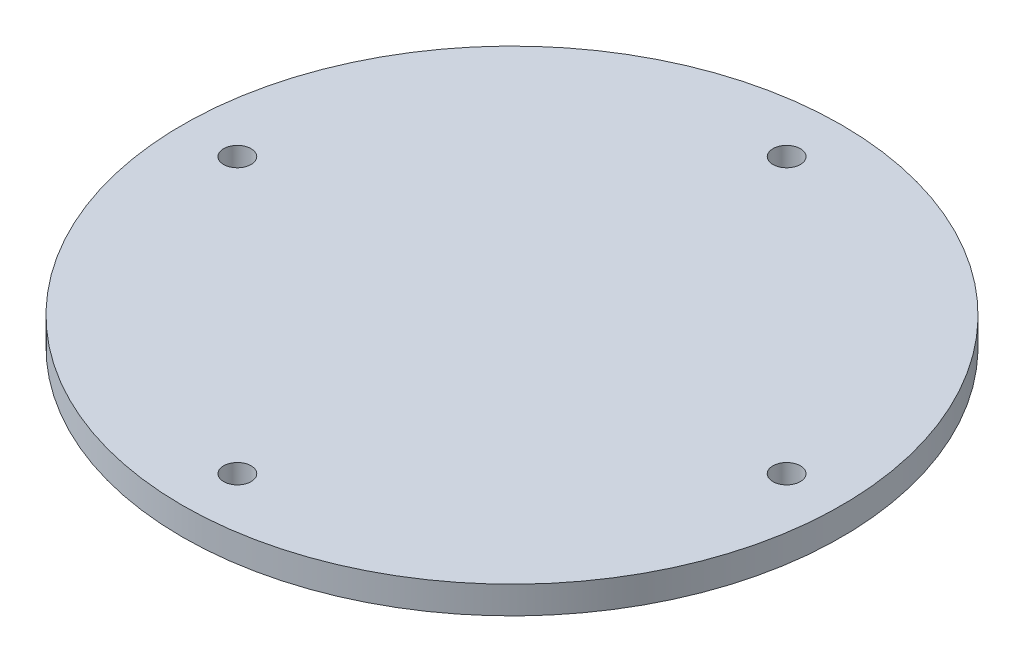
ISO-10303-21;
HEADER;
FILE_DESCRIPTION(('STEP AP214'),'2;1');
FILE_NAME('part.step','',(''),(''),'','','');
FILE_SCHEMA(('AUTOMOTIVE_DESIGN { 1 0 10303 214 1 1 1 1 }'));
ENDSEC;
DATA;
#1=APPLICATION_CONTEXT('core data for automotive mechanical design processes');
#2=APPLICATION_PROTOCOL_DEFINITION('international standard','automotive_design',2000,#1);
#3=PRODUCT_CONTEXT('',#1,'mechanical');
#4=PRODUCT('Part','Part','',(#3));
#5=PRODUCT_RELATED_PRODUCT_CATEGORY('part','',(#4));
#6=PRODUCT_DEFINITION_FORMATION('','',#4);
#7=PRODUCT_DEFINITION_CONTEXT('part definition',#1,'design');
#8=PRODUCT_DEFINITION('design','',#6,#7);
#9=PRODUCT_DEFINITION_SHAPE('','',#8);
#10=(LENGTH_UNIT() NAMED_UNIT(*) SI_UNIT(.MILLI.,.METRE.));
#11=(NAMED_UNIT(*) PLANE_ANGLE_UNIT() SI_UNIT($,.RADIAN.));
#12=(NAMED_UNIT(*) SI_UNIT($,.STERADIAN.) SOLID_ANGLE_UNIT());
#13=UNCERTAINTY_MEASURE_WITH_UNIT(LENGTH_MEASURE(1.E-05),#10,'distance_accuracy_value','');
#14=(GEOMETRIC_REPRESENTATION_CONTEXT(3) GLOBAL_UNCERTAINTY_ASSIGNED_CONTEXT((#13)) GLOBAL_UNIT_ASSIGNED_CONTEXT((#10,
#11,#12)) REPRESENTATION_CONTEXT('',''));
#15=CARTESIAN_POINT('',(0.,0.,0.));
#16=DIRECTION('',(0.,0.,1.));
#17=DIRECTION('',(1.,0.,0.));
#18=AXIS2_PLACEMENT_3D('',#15,#16,#17);
#19=CARTESIAN_POINT('',(0.,2.5,0.));
#20=DIRECTION('',(0.,1.,0.));
#21=DIRECTION('',(0.,0.,1.));
#22=AXIS2_PLACEMENT_3D('',#19,#20,#21);
#23=PLANE('',#22);
#24=CARTESIAN_POINT('',(1.55278452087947E-12,2.5,25.));
#25=DIRECTION('',(0.,1.,0.));
#26=DIRECTION('',(0.,0.,1.));
#27=AXIS2_PLACEMENT_3D('',#24,#25,#26);
#28=CIRCLE('',#27,1.25);
#29=CARTESIAN_POINT('',(1.55278452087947E-12,2.5,26.25));
#30=VERTEX_POINT('',#29);
#31=EDGE_CURVE('E57',#30,#30,#28,.T.);
#32=ORIENTED_EDGE('',*,*,#31,.F.);
#33=EDGE_LOOP('',(#32));
#34=FACE_BOUND('',#33,.T.);
#35=CARTESIAN_POINT('',(0.,2.5,-25.));
#36=DIRECTION('',(0.,1.,0.));
#37=DIRECTION('',(0.,0.,1.));
#38=AXIS2_PLACEMENT_3D('',#35,#36,#37);
#39=CIRCLE('',#38,1.25);
#40=CARTESIAN_POINT('',(0.,2.5,-23.75));
#41=VERTEX_POINT('',#40);
#42=EDGE_CURVE('E46',#41,#41,#39,.T.);
#43=ORIENTED_EDGE('',*,*,#42,.F.);
#44=EDGE_LOOP('',(#43));
#45=FACE_BOUND('',#44,.T.);
#46=CARTESIAN_POINT('',(0.,2.5,0.));
#47=DIRECTION('',(0.,1.,0.));
#48=DIRECTION('',(0.,0.,1.));
#49=AXIS2_PLACEMENT_3D('',#46,#47,#48);
#50=CIRCLE('',#49,30.);
#51=CARTESIAN_POINT('',(0.,2.5,30.));
#52=VERTEX_POINT('',#51);
#53=EDGE_CURVE('E10',#52,#52,#50,.T.);
#54=ORIENTED_EDGE('',*,*,#53,.T.);
#55=EDGE_LOOP('',(#54));
#56=FACE_BOUND('',#55,.T.);
#57=CARTESIAN_POINT('',(25.0000000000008,2.5,-7.76392260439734E-13));
#58=DIRECTION('',(0.,1.,0.));
#59=DIRECTION('',(0.,0.,1.));
#60=AXIS2_PLACEMENT_3D('',#57,#58,#59);
#61=CIRCLE('',#60,1.25);
#62=CARTESIAN_POINT('',(25.0000000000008,2.5,1.24999999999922));
#63=VERTEX_POINT('',#62);
#64=EDGE_CURVE('E51',#63,#63,#61,.T.);
#65=ORIENTED_EDGE('',*,*,#64,.F.);
#66=EDGE_LOOP('',(#65));
#67=FACE_BOUND('',#66,.T.);
#68=CARTESIAN_POINT('',(-24.9999999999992,2.5,7.79453877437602E-13));
#69=DIRECTION('',(0.,1.,0.));
#70=DIRECTION('',(0.,0.,1.));
#71=AXIS2_PLACEMENT_3D('',#68,#69,#70);
#72=CIRCLE('',#71,1.25);
#73=CARTESIAN_POINT('',(-24.9999999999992,2.5,1.25000000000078));
#74=VERTEX_POINT('',#73);
#75=EDGE_CURVE('E63',#74,#74,#72,.T.);
#76=ORIENTED_EDGE('',*,*,#75,.F.);
#77=EDGE_LOOP('',(#76));
#78=FACE_BOUND('',#77,.T.);
#79=ADVANCED_FACE('F35',(#34,#45,#56,#67,#78),#23,.T.);
#80=CARTESIAN_POINT('',(0.,0.,0.));
#81=DIRECTION('',(0.,1.,0.));
#82=DIRECTION('',(0.,0.,1.));
#83=AXIS2_PLACEMENT_3D('',#80,#81,#82);
#84=PLANE('',#83);
#85=CARTESIAN_POINT('',(0.,0.,0.));
#86=DIRECTION('',(0.,1.,0.));
#87=DIRECTION('',(0.,0.,1.));
#88=AXIS2_PLACEMENT_3D('',#85,#86,#87);
#89=CIRCLE('',#88,30.);
#90=CARTESIAN_POINT('',(0.,0.,30.));
#91=VERTEX_POINT('',#90);
#92=EDGE_CURVE('E39',#91,#91,#89,.T.);
#93=ORIENTED_EDGE('',*,*,#92,.F.);
#94=EDGE_LOOP('',(#93));
#95=FACE_BOUND('',#94,.T.);
#96=CARTESIAN_POINT('',(0.,0.,-25.));
#97=DIRECTION('',(0.,1.,0.));
#98=DIRECTION('',(0.,0.,1.));
#99=AXIS2_PLACEMENT_3D('',#96,#97,#98);
#100=CIRCLE('',#99,1.25);
#101=CARTESIAN_POINT('',(0.,0.,-23.75));
#102=VERTEX_POINT('',#101);
#103=EDGE_CURVE('E48',#102,#102,#100,.T.);
#104=ORIENTED_EDGE('',*,*,#103,.T.);
#105=EDGE_LOOP('',(#104));
#106=FACE_BOUND('',#105,.T.);
#107=CARTESIAN_POINT('',(25.0000000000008,0.,-7.76392260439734E-13));
#108=DIRECTION('',(0.,1.,0.));
#109=DIRECTION('',(0.,0.,1.));
#110=AXIS2_PLACEMENT_3D('',#107,#108,#109);
#111=CIRCLE('',#110,1.25);
#112=CARTESIAN_POINT('',(25.0000000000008,0.,1.24999999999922));
#113=VERTEX_POINT('',#112);
#114=EDGE_CURVE('E54',#113,#113,#111,.T.);
#115=ORIENTED_EDGE('',*,*,#114,.T.);
#116=EDGE_LOOP('',(#115));
#117=FACE_BOUND('',#116,.T.);
#118=CARTESIAN_POINT('',(1.55278452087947E-12,0.,25.));
#119=DIRECTION('',(0.,1.,0.));
#120=DIRECTION('',(0.,0.,1.));
#121=AXIS2_PLACEMENT_3D('',#118,#119,#120);
#122=CIRCLE('',#121,1.25);
#123=CARTESIAN_POINT('',(1.55278452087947E-12,0.,26.25));
#124=VERTEX_POINT('',#123);
#125=EDGE_CURVE('E60',#124,#124,#122,.T.);
#126=ORIENTED_EDGE('',*,*,#125,.T.);
#127=EDGE_LOOP('',(#126));
#128=FACE_BOUND('',#127,.T.);
#129=CARTESIAN_POINT('',(-24.9999999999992,0.,7.79453877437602E-13));
#130=DIRECTION('',(0.,1.,0.));
#131=DIRECTION('',(0.,0.,1.));
#132=AXIS2_PLACEMENT_3D('',#129,#130,#131);
#133=CIRCLE('',#132,1.25);
#134=CARTESIAN_POINT('',(-24.9999999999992,0.,1.25000000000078));
#135=VERTEX_POINT('',#134);
#136=EDGE_CURVE('E66',#135,#135,#133,.T.);
#137=ORIENTED_EDGE('',*,*,#136,.T.);
#138=EDGE_LOOP('',(#137));
#139=FACE_BOUND('',#138,.T.);
#140=ADVANCED_FACE('F76',(#95,#106,#117,#128,#139),#84,.F.);
#141=CARTESIAN_POINT('',(0.,2.5,0.));
#142=DIRECTION('',(0.,-1.,0.));
#143=DIRECTION('',(0.,0.,-1.));
#144=AXIS2_PLACEMENT_3D('',#141,#142,#143);
#145=CYLINDRICAL_SURFACE('',#144,30.);
#146=ORIENTED_EDGE('',*,*,#53,.F.);
#147=EDGE_LOOP('',(#146));
#148=FACE_BOUND('',#147,.T.);
#149=ORIENTED_EDGE('',*,*,#92,.T.);
#150=EDGE_LOOP('',(#149));
#151=FACE_BOUND('',#150,.T.);
#152=ADVANCED_FACE('F37',(#148,#151),#145,.T.);
#153=CARTESIAN_POINT('',(0.,2.5,-25.));
#154=DIRECTION('',(0.,-1.,0.));
#155=DIRECTION('',(0.,0.,-1.));
#156=AXIS2_PLACEMENT_3D('',#153,#154,#155);
#157=CYLINDRICAL_SURFACE('',#156,1.25);
#158=ORIENTED_EDGE('',*,*,#42,.T.);
#159=EDGE_LOOP('',(#158));
#160=FACE_BOUND('',#159,.T.);
#161=ORIENTED_EDGE('',*,*,#103,.F.);
#162=EDGE_LOOP('',(#161));
#163=FACE_BOUND('',#162,.T.);
#164=ADVANCED_FACE('F86',(#160,#163),#157,.F.);
#165=CARTESIAN_POINT('',(25.0000000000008,2.5,-7.76392260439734E-13));
#166=DIRECTION('',(0.,-1.,0.));
#167=DIRECTION('',(0.,0.,-1.));
#168=AXIS2_PLACEMENT_3D('',#165,#166,#167);
#169=CYLINDRICAL_SURFACE('',#168,1.25);
#170=ORIENTED_EDGE('',*,*,#64,.T.);
#171=EDGE_LOOP('',(#170));
#172=FACE_BOUND('',#171,.T.);
#173=ORIENTED_EDGE('',*,*,#114,.F.);
#174=EDGE_LOOP('',(#173));
#175=FACE_BOUND('',#174,.T.);
#176=ADVANCED_FACE('F89',(#172,#175),#169,.F.);
#177=CARTESIAN_POINT('',(1.55278452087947E-12,2.5,25.));
#178=DIRECTION('',(0.,-1.,0.));
#179=DIRECTION('',(0.,0.,-1.));
#180=AXIS2_PLACEMENT_3D('',#177,#178,#179);
#181=CYLINDRICAL_SURFACE('',#180,1.25);
#182=ORIENTED_EDGE('',*,*,#31,.T.);
#183=EDGE_LOOP('',(#182));
#184=FACE_BOUND('',#183,.T.);
#185=ORIENTED_EDGE('',*,*,#125,.F.);
#186=EDGE_LOOP('',(#185));
#187=FACE_BOUND('',#186,.T.);
#188=ADVANCED_FACE('F93',(#184,#187),#181,.F.);
#189=CARTESIAN_POINT('',(-24.9999999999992,2.5,7.79453877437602E-13));
#190=DIRECTION('',(0.,-1.,0.));
#191=DIRECTION('',(0.,0.,-1.));
#192=AXIS2_PLACEMENT_3D('',#189,#190,#191);
#193=CYLINDRICAL_SURFACE('',#192,1.25);
#194=ORIENTED_EDGE('',*,*,#75,.T.);
#195=EDGE_LOOP('',(#194));
#196=FACE_BOUND('',#195,.T.);
#197=ORIENTED_EDGE('',*,*,#136,.F.);
#198=EDGE_LOOP('',(#197));
#199=FACE_BOUND('',#198,.T.);
#200=ADVANCED_FACE('F72',(#196,#199),#193,.F.);
#201=CLOSED_SHELL('',(#79,#140,#152,#164,#176,#188,#200));
#202=MANIFOLD_SOLID_BREP('B2',#201);
#203=ADVANCED_BREP_SHAPE_REPRESENTATION('',(#18,#202),#14);
#204=SHAPE_DEFINITION_REPRESENTATION(#9,#203);
ENDSEC;
END-ISO-10303-21;
